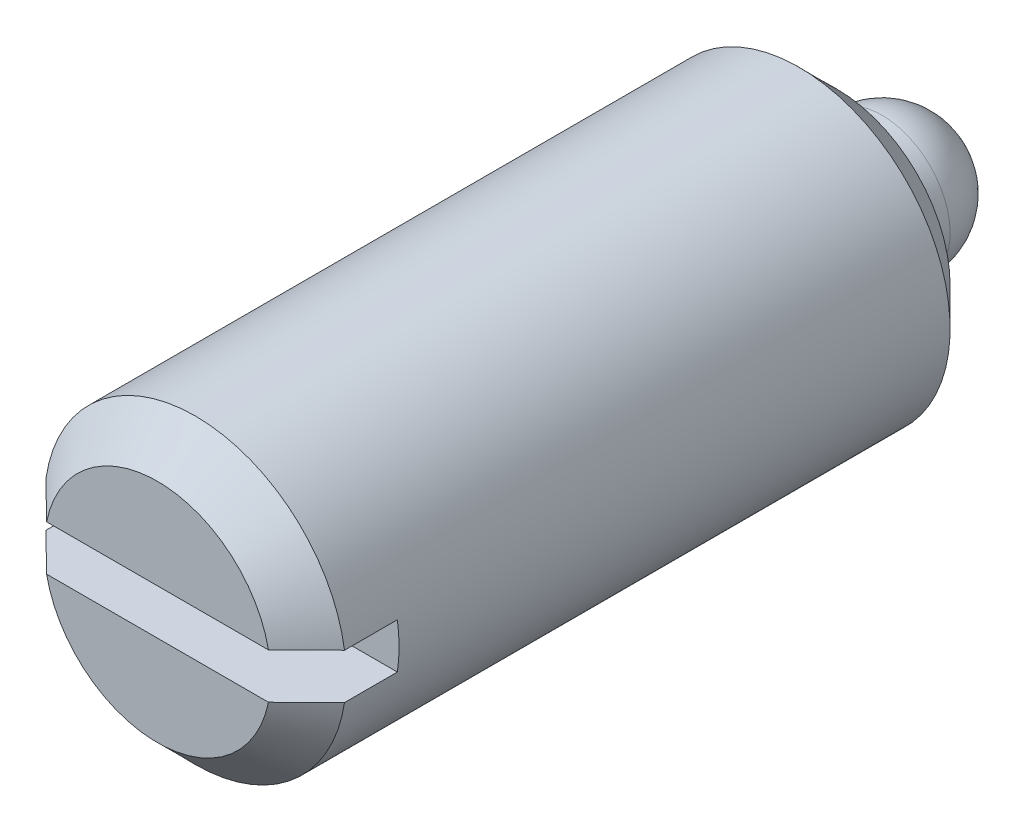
ISO-10303-21;
HEADER;
FILE_DESCRIPTION(('STEP AP214'),'2;1');
FILE_NAME('part.step','',(''),(''),'','','');
FILE_SCHEMA(('AUTOMOTIVE_DESIGN { 1 0 10303 214 1 1 1 1 }'));
ENDSEC;
DATA;
#1=APPLICATION_CONTEXT('core data for automotive mechanical design processes');
#2=APPLICATION_PROTOCOL_DEFINITION('international standard','automotive_design',2000,#1);
#3=PRODUCT_CONTEXT('',#1,'mechanical');
#4=PRODUCT('Part','Part','',(#3));
#5=PRODUCT_RELATED_PRODUCT_CATEGORY('part','',(#4));
#6=PRODUCT_DEFINITION_FORMATION('','',#4);
#7=PRODUCT_DEFINITION_CONTEXT('part definition',#1,'design');
#8=PRODUCT_DEFINITION('design','',#6,#7);
#9=PRODUCT_DEFINITION_SHAPE('','',#8);
#10=(LENGTH_UNIT() NAMED_UNIT(*) SI_UNIT(.MILLI.,.METRE.));
#11=(NAMED_UNIT(*) PLANE_ANGLE_UNIT() SI_UNIT($,.RADIAN.));
#12=(NAMED_UNIT(*) SI_UNIT($,.STERADIAN.) SOLID_ANGLE_UNIT());
#13=UNCERTAINTY_MEASURE_WITH_UNIT(LENGTH_MEASURE(1.E-05),#10,'distance_accuracy_value','');
#14=(GEOMETRIC_REPRESENTATION_CONTEXT(3) GLOBAL_UNCERTAINTY_ASSIGNED_CONTEXT((#13)) GLOBAL_UNIT_ASSIGNED_CONTEXT((#10,
#11,#12)) REPRESENTATION_CONTEXT('',''));
#15=CARTESIAN_POINT('',(0.,0.,0.));
#16=DIRECTION('',(0.,0.,1.));
#17=DIRECTION('',(1.,0.,0.));
#18=AXIS2_PLACEMENT_3D('',#15,#16,#17);
#19=CARTESIAN_POINT('',(-5.98901694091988E-11,-9.E-09,0.9));
#20=DIRECTION('',(-6.65446347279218E-11,0.,1.));
#21=DIRECTION('',(0.,-1.,0.));
#22=AXIS2_PLACEMENT_3D('',#19,#20,#21);
#23=SPHERICAL_SURFACE('',#22,0.9);
#24=CARTESIAN_POINT('',(0.,0.,0.));
#25=VERTEX_POINT('',#24);
#26=VERTEX_LOOP('',#25);
#27=FACE_BOUND('',#26,.T.);
#28=CARTESIAN_POINT('',(-5.98901694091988E-11,-9.E-09,0.9));
#29=DIRECTION('',(-6.65446347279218E-11,0.,1.));
#30=DIRECTION('',(-1.,0.,-6.65446347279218E-11));
#31=AXIS2_PLACEMENT_3D('',#28,#29,#30);
#32=CIRCLE('',#31,0.9);
#33=CARTESIAN_POINT('',(-0.90000000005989,-9.E-09,0.89999999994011));
#34=VERTEX_POINT('',#33);
#35=EDGE_CURVE('E78',#34,#34,#32,.T.);
#36=ORIENTED_EDGE('',*,*,#35,.F.);
#37=EDGE_LOOP('',(#36));
#38=FACE_BOUND('',#37,.T.);
#39=ADVANCED_FACE('F15',(#27,#38),#23,.T.);
#40=CARTESIAN_POINT('',(-5.98901694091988E-11,-9.E-09,0.9));
#41=DIRECTION('',(-6.65446347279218E-11,0.,1.));
#42=DIRECTION('',(-1.,0.,-6.65446347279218E-11));
#43=AXIS2_PLACEMENT_3D('',#40,#41,#42);
#44=CYLINDRICAL_SURFACE('',#43,0.9);
#45=CARTESIAN_POINT('',(-9.98169502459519E-11,-9.E-09,1.5));
#46=DIRECTION('',(-6.65446347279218E-11,0.,1.));
#47=DIRECTION('',(-1.,0.,-6.65446347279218E-11));
#48=AXIS2_PLACEMENT_3D('',#45,#46,#47);
#49=CIRCLE('',#48,0.9);
#50=CARTESIAN_POINT('',(-0.900000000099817,-9.E-09,1.49999999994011));
#51=VERTEX_POINT('',#50);
#52=EDGE_CURVE('E19',#51,#51,#49,.F.);
#53=ORIENTED_EDGE('',*,*,#52,.T.);
#54=EDGE_LOOP('',(#53));
#55=FACE_BOUND('',#54,.T.);
#56=ORIENTED_EDGE('',*,*,#35,.T.);
#57=EDGE_LOOP('',(#56));
#58=FACE_BOUND('',#57,.T.);
#59=ADVANCED_FACE('F74',(#55,#58),#44,.T.);
#60=CARTESIAN_POINT('',(-1.48733017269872,1.519292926,10.499999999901));
#61=DIRECTION('',(6.65446347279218E-11,0.,-1.));
#62=DIRECTION('',(1.,0.,6.65446347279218E-11));
#63=AXIS2_PLACEMENT_3D('',#60,#61,#62);
#64=PLANE('',#63);
#65=DIRECTION('',(1.,0.,6.65446347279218E-11));
#66=VECTOR('',#65,1.);
#67=CARTESIAN_POINT('',(-6.98718662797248E-10,0.299999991,10.5));
#68=LINE('',#67,#66);
#69=CARTESIAN_POINT('',(-1.46969384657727,0.299999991,10.4999999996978));
#70=VERTEX_POINT('',#69);
#71=CARTESIAN_POINT('',(1.46969384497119,0.299999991,10.5000000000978));
#72=VERTEX_POINT('',#71);
#73=EDGE_CURVE('E145',#70,#72,#68,.T.);
#74=ORIENTED_EDGE('',*,*,#73,.T.);
#75=CARTESIAN_POINT('',(-6.98718662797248E-10,-9.E-09,10.5));
#76=DIRECTION('',(6.65446347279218E-11,0.,-1.));
#77=DIRECTION('',(1.,0.,6.65446347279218E-11));
#78=AXIS2_PLACEMENT_3D('',#75,#76,#77);
#79=CIRCLE('',#78,1.5);
#80=EDGE_CURVE('E68',#70,#72,#79,.T.);
#81=ORIENTED_EDGE('',*,*,#80,.F.);
#82=EDGE_LOOP('',(#74,#81));
#83=FACE_BOUND('',#82,.T.);
#84=ADVANCED_FACE('F172',(#83),#64,.F.);
#85=CARTESIAN_POINT('',(1.51799999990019,1.523223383,1.50000000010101));
#86=DIRECTION('',(-6.65446347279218E-11,0.,1.));
#87=DIRECTION('',(-1.,0.,-6.65446347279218E-11));
#88=AXIS2_PLACEMENT_3D('',#85,#86,#87);
#89=PLANE('',#88);
#90=ORIENTED_EDGE('',*,*,#52,.F.);
#91=EDGE_LOOP('',(#90));
#92=FACE_BOUND('',#91,.T.);
#93=CARTESIAN_POINT('',(-9.98169502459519E-11,-9.E-09,1.5));
#94=DIRECTION('',(-6.65446347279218E-11,0.,1.));
#95=DIRECTION('',(-1.,0.,-6.65446347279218E-11));
#96=AXIS2_PLACEMENT_3D('',#93,#94,#95);
#97=CIRCLE('',#96,1.5);
#98=CARTESIAN_POINT('',(-1.50000000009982,-9.E-09,1.49999999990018));
#99=VERTEX_POINT('',#98);
#100=EDGE_CURVE('E186',#99,#99,#97,.T.);
#101=ORIENTED_EDGE('',*,*,#100,.F.);
#102=EDGE_LOOP('',(#101));
#103=FACE_BOUND('',#102,.T.);
#104=ADVANCED_FACE('F174',(#92,#103),#89,.F.);
#105=CARTESIAN_POINT('',(-1.48733017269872,-0.300000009,10.499999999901));
#106=DIRECTION('',(6.65446347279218E-11,0.,-1.));
#107=DIRECTION('',(1.,0.,6.65446347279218E-11));
#108=AXIS2_PLACEMENT_3D('',#105,#106,#107);
#109=PLANE('',#108);
#110=DIRECTION('',(-1.,0.,-6.65446347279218E-11));
#111=VECTOR('',#110,1.);
#112=CARTESIAN_POINT('',(-6.98718662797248E-10,-0.300000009,10.5));
#113=LINE('',#112,#111);
#114=CARTESIAN_POINT('',(1.46969384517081,-0.300000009,10.4999999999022));
#115=VERTEX_POINT('',#114);
#116=CARTESIAN_POINT('',(-1.46969384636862,-0.300000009,10.4999999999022));
#117=VERTEX_POINT('',#116);
#118=EDGE_CURVE('E104',#115,#117,#113,.T.);
#119=ORIENTED_EDGE('',*,*,#118,.T.);
#120=CARTESIAN_POINT('',(-6.98718662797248E-10,-9.E-09,10.5));
#121=DIRECTION('',(6.65446347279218E-11,0.,-1.));
#122=DIRECTION('',(1.,0.,6.65446347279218E-11));
#123=AXIS2_PLACEMENT_3D('',#120,#121,#122);
#124=CIRCLE('',#123,1.5);
#125=EDGE_CURVE('E188',#115,#117,#124,.T.);
#126=ORIENTED_EDGE('',*,*,#125,.F.);
#127=EDGE_LOOP('',(#119,#126));
#128=FACE_BOUND('',#127,.T.);
#129=ADVANCED_FACE('F127',(#128),#109,.F.);
#130=CARTESIAN_POINT('',(-6.98718662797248E-10,-9.E-09,10.5));
#131=DIRECTION('',(6.65446347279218E-11,0.,-1.));
#132=DIRECTION('',(1.,0.,6.65446347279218E-11));
#133=AXIS2_PLACEMENT_3D('',#130,#131,#132);
#134=CONICAL_SURFACE('',#133,1.5,0.785398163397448);
#135=ORIENTED_EDGE('',*,*,#80,.T.);
#136=CARTESIAN_POINT('',(1.46969384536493,0.299999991,10.499999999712));
#137=CARTESIAN_POINT('',(1.51210680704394,0.299999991,10.4584415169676));
#138=CARTESIAN_POINT('',(1.55448600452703,0.299999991,10.4168486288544));
#139=CARTESIAN_POINT('',(1.63918756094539,0.299999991,10.3336051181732));
#140=CARTESIAN_POINT('',(1.6815099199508,0.299999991,10.2919544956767));
#141=CARTESIAN_POINT('',(1.80840793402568,0.299999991,10.1669324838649));
#142=CARTESIAN_POINT('',(1.89291452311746,0.299999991,10.0834909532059));
#143=CARTESIAN_POINT('',(1.9773719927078,0.299999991,10.0000000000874));
#144=B_SPLINE_CURVE_WITH_KNOTS('',3,(#136,#137,#138,#139,#140,#141,#142,#143),.UNSPECIFIED.,.F.,
.F.,(4,2,2,4),(0.,0.178139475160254,0.356278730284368,0.712557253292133),.UNSPECIFIED.);
#145=CARTESIAN_POINT('',(1.97737199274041,0.299999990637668,10.0000000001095));
#146=VERTEX_POINT('',#145);
#147=EDGE_CURVE('E131',#72,#146,#144,.T.);
#148=ORIENTED_EDGE('',*,*,#147,.T.);
#149=CARTESIAN_POINT('',(-6.65446345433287E-10,-9.E-09,10.));
#150=DIRECTION('',(-6.65446347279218E-11,0.,1.));
#151=DIRECTION('',(-1.,0.,-6.65446347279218E-11));
#152=AXIS2_PLACEMENT_3D('',#149,#150,#151);
#153=CIRCLE('',#152,2.);
#154=CARTESIAN_POINT('',(-1.97737199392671,0.299999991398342,9.99999999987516));
#155=VERTEX_POINT('',#154);
#156=EDGE_CURVE('E223',#155,#146,#153,.F.);
#157=ORIENTED_EDGE('',*,*,#156,.F.);
#158=CARTESIAN_POINT('',(-1.97737199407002,0.299999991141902,9.99999999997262));
#159=CARTESIAN_POINT('',(-1.89291452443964,0.299999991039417,10.0834909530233));
#160=CARTESIAN_POINT('',(-1.80840793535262,0.299999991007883,10.16693248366));
#161=CARTESIAN_POINT('',(-1.68150992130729,0.299999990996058,10.291954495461));
#162=CARTESIAN_POINT('',(-1.63918756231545,0.299999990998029,10.3336051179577));
#163=CARTESIAN_POINT('',(-1.55448600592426,0.299999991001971,10.4168486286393));
#164=CARTESIAN_POINT('',(-1.51210680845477,0.299999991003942,10.4584415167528));
#165=CARTESIAN_POINT('',(-1.46969384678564,0.299999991,10.4999999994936));
#166=B_SPLINE_CURVE_WITH_KNOTS('',3,(#158,#159,#160,#161,#162,#163,#164,#165),.UNSPECIFIED.,.F.,
.F.,(4,2,2,4),(0.,0.356278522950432,0.534417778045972,0.712557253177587),.UNSPECIFIED.);
#167=EDGE_CURVE('E139',#155,#70,#166,.T.);
#168=ORIENTED_EDGE('',*,*,#167,.T.);
#169=EDGE_LOOP('',(#135,#148,#157,#168));
#170=FACE_BOUND('',#169,.T.);
#171=ADVANCED_FACE('F125',(#170),#134,.T.);
#172=CARTESIAN_POINT('',(-1.97737199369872,0.299999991,10.4999999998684));
#173=DIRECTION('',(0.,1.,0.));
#174=DIRECTION('',(1.,0.,6.65446347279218E-11));
#175=AXIS2_PLACEMENT_3D('',#172,#173,#174);
#176=PLANE('',#175);
#177=DIRECTION('',(6.65446347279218E-11,0.,-1.));
#178=VECTOR('',#177,1.);
#179=CARTESIAN_POINT('',(1.9773719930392,0.299999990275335,6.00000000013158));
#180=LINE('',#179,#178);
#181=CARTESIAN_POINT('',(1.97737199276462,0.299999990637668,9.30000000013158));
#182=VERTEX_POINT('',#181);
#183=EDGE_CURVE('E221',#146,#182,#180,.T.);
#184=ORIENTED_EDGE('',*,*,#183,.F.);
#185=ORIENTED_EDGE('',*,*,#147,.F.);
#186=ORIENTED_EDGE('',*,*,#73,.F.);
#187=ORIENTED_EDGE('',*,*,#167,.F.);
#188=DIRECTION('',(-6.65446347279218E-11,0.,1.));
#189=VECTOR('',#188,1.);
#190=CARTESIAN_POINT('',(-1.97737199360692,0.299999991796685,5.99999999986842));
#191=LINE('',#190,#189);
#192=CARTESIAN_POINT('',(-1.97737199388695,0.299999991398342,9.29999999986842));
#193=VERTEX_POINT('',#192);
#194=EDGE_CURVE('E86',#193,#155,#191,.T.);
#195=ORIENTED_EDGE('',*,*,#194,.F.);
#196=DIRECTION('',(1.,0.,6.65446347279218E-11));
#197=VECTOR('',#196,1.);
#198=CARTESIAN_POINT('',(-6.18865101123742E-10,0.299999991,9.3));
#199=LINE('',#198,#197);
#200=EDGE_CURVE('E103',#193,#182,#199,.T.);
#201=ORIENTED_EDGE('',*,*,#200,.T.);
#202=EDGE_LOOP('',(#184,#185,#186,#187,#195,#201));
#203=FACE_BOUND('',#202,.T.);
#204=ADVANCED_FACE('F119',(#203),#176,.F.);
#205=CARTESIAN_POINT('',(-9.98169502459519E-11,-9.E-09,1.5));
#206=DIRECTION('',(-6.65446347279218E-11,0.,1.));
#207=DIRECTION('',(-1.,0.,-6.65446347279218E-11));
#208=AXIS2_PLACEMENT_3D('',#205,#206,#207);
#209=CONICAL_SURFACE('',#208,1.5,0.785398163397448);
#210=CARTESIAN_POINT('',(-1.33089267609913E-10,-9.E-09,2.));
#211=DIRECTION('',(-6.65446347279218E-11,0.,1.));
#212=DIRECTION('',(-1.,0.,-6.65446347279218E-11));
#213=AXIS2_PLACEMENT_3D('',#210,#211,#212);
#214=CIRCLE('',#213,2.);
#215=CARTESIAN_POINT('',(-2.00000000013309,-9.E-09,1.99999999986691));
#216=VERTEX_POINT('',#215);
#217=EDGE_CURVE('E94',#216,#216,#214,.T.);
#218=ORIENTED_EDGE('',*,*,#217,.F.);
#219=EDGE_LOOP('',(#218));
#220=FACE_BOUND('',#219,.T.);
#221=ORIENTED_EDGE('',*,*,#100,.T.);
#222=EDGE_LOOP('',(#221));
#223=FACE_BOUND('',#222,.T.);
#224=ADVANCED_FACE('F124',(#220,#223),#209,.T.);
#225=CARTESIAN_POINT('',(-6.98718662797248E-10,-9.E-09,10.5));
#226=DIRECTION('',(6.65446347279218E-11,0.,-1.));
#227=DIRECTION('',(1.,0.,6.65446347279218E-11));
#228=AXIS2_PLACEMENT_3D('',#225,#226,#227);
#229=CONICAL_SURFACE('',#228,1.5,0.785398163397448);
#230=CARTESIAN_POINT('',(-6.65446345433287E-10,-9.E-09,10.));
#231=DIRECTION('',(-6.65446347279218E-11,0.,1.));
#232=DIRECTION('',(-1.,0.,-6.65446347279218E-11));
#233=AXIS2_PLACEMENT_3D('',#230,#231,#232);
#234=CIRCLE('',#233,2.);
#235=CARTESIAN_POINT('',(1.97737199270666,-0.300000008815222,10.0000000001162));
#236=VERTEX_POINT('',#235);
#237=CARTESIAN_POINT('',(-1.97737199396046,-0.300000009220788,9.99999999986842));
#238=VERTEX_POINT('',#237);
#239=EDGE_CURVE('E211',#236,#238,#234,.F.);
#240=ORIENTED_EDGE('',*,*,#239,.F.);
#241=CARTESIAN_POINT('',(1.97737199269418,-0.300000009,10.0000000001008));
#242=CARTESIAN_POINT('',(1.89291452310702,-0.300000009,10.0834909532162));
#243=CARTESIAN_POINT('',(1.80840793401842,-0.300000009,10.1669324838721));
#244=CARTESIAN_POINT('',(1.68150991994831,-0.300000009,10.2919544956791));
#245=CARTESIAN_POINT('',(1.63918756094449,-0.300000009,10.3336051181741));
#246=CARTESIAN_POINT('',(1.55448600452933,-0.300000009,10.4168486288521));
#247=CARTESIAN_POINT('',(1.51210680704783,-0.300000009,10.4584415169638));
#248=CARTESIAN_POINT('',(1.46969384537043,-0.300000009,10.4999999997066));
#249=B_SPLINE_CURVE_WITH_KNOTS('',3,(#241,#242,#243,#244,#245,#246,#247,#248),.UNSPECIFIED.,.F.,
.F.,(4,2,2,4),(0.,0.356278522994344,0.534417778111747,0.712557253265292),.UNSPECIFIED.);
#250=EDGE_CURVE('E105',#236,#115,#249,.T.);
#251=ORIENTED_EDGE('',*,*,#250,.T.);
#252=ORIENTED_EDGE('',*,*,#125,.T.);
#253=CARTESIAN_POINT('',(-1.46969384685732,-0.300000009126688,10.4999999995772));
#254=CARTESIAN_POINT('',(-1.51210680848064,-0.300000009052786,10.4584415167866));
#255=CARTESIAN_POINT('',(-1.55448600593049,-0.300000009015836,10.41684862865));
#256=CARTESIAN_POINT('',(-1.63918756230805,-0.300000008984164,10.3336051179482));
#257=CARTESIAN_POINT('',(-1.68150992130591,-0.300000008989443,10.2919544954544));
#258=CARTESIAN_POINT('',(-1.80840793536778,-0.300000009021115,10.1669324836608));
#259=CARTESIAN_POINT('',(-1.89291452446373,-0.300000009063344,10.0834909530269));
#260=CARTESIAN_POINT('',(-1.9773719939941,-0.300000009,9.99999999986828));
#261=B_SPLINE_CURVE_WITH_KNOTS('',3,(#253,#254,#255,#256,#257,#258,#259,#260),.UNSPECIFIED.,.F.,
.F.,(4,2,2,4),(0.,0.178139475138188,0.356278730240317,0.712557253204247),.UNSPECIFIED.);
#262=EDGE_CURVE('E95',#117,#238,#261,.T.);
#263=ORIENTED_EDGE('',*,*,#262,.T.);
#264=EDGE_LOOP('',(#240,#251,#252,#263));
#265=FACE_BOUND('',#264,.T.);
#266=ADVANCED_FACE('F111',(#265),#229,.T.);
#267=CARTESIAN_POINT('',(1.97737199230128,-0.300000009,10.5000000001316));
#268=DIRECTION('',(0.,-1.,0.));
#269=DIRECTION('',(-1.,0.,-6.65446347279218E-11));
#270=AXIS2_PLACEMENT_3D('',#267,#268,#269);
#271=PLANE('',#270);
#272=ORIENTED_EDGE('',*,*,#118,.F.);
#273=ORIENTED_EDGE('',*,*,#250,.F.);
#274=DIRECTION('',(-6.65446347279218E-11,0.,1.));
#275=VECTOR('',#274,1.);
#276=CARTESIAN_POINT('',(1.97737199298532,-0.300000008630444,6.00000000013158));
#277=LINE('',#276,#275);
#278=CARTESIAN_POINT('',(1.97737199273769,-0.300000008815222,9.30000000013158));
#279=VERTEX_POINT('',#278);
#280=EDGE_CURVE('E93',#279,#236,#277,.T.);
#281=ORIENTED_EDGE('',*,*,#280,.F.);
#282=DIRECTION('',(-1.,0.,-6.65446347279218E-11));
#283=VECTOR('',#282,1.);
#284=CARTESIAN_POINT('',(-6.18865101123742E-10,-0.300000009,9.3));
#285=LINE('',#284,#283);
#286=CARTESIAN_POINT('',(-1.97737199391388,-0.300000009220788,9.29999999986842));
#287=VERTEX_POINT('',#286);
#288=EDGE_CURVE('E35',#279,#287,#285,.T.);
#289=ORIENTED_EDGE('',*,*,#288,.T.);
#290=DIRECTION('',(6.65446347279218E-11,0.,-1.));
#291=VECTOR('',#290,1.);
#292=CARTESIAN_POINT('',(-1.97737199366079,-0.300000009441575,5.99999999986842));
#293=LINE('',#292,#291);
#294=EDGE_CURVE('E26',#238,#287,#293,.T.);
#295=ORIENTED_EDGE('',*,*,#294,.F.);
#296=ORIENTED_EDGE('',*,*,#262,.F.);
#297=EDGE_LOOP('',(#272,#273,#281,#289,#295,#296));
#298=FACE_BOUND('',#297,.T.);
#299=ADVANCED_FACE('F115',(#298),#271,.F.);
#300=CARTESIAN_POINT('',(-2.02400000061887,0.299999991,9.29999999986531));
#301=DIRECTION('',(6.65446347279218E-11,0.,-1.));
#302=DIRECTION('',(1.,0.,6.65446347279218E-11));
#303=AXIS2_PLACEMENT_3D('',#300,#301,#302);
#304=PLANE('',#303);
#305=CARTESIAN_POINT('',(-6.18865101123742E-10,-9.E-09,9.3));
#306=DIRECTION('',(-6.65446347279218E-11,0.,1.));
#307=DIRECTION('',(-1.,0.,-6.65446347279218E-11));
#308=AXIS2_PLACEMENT_3D('',#305,#306,#307);
#309=CIRCLE('',#308,2.);
#310=EDGE_CURVE('E89',#182,#279,#309,.F.);
#311=ORIENTED_EDGE('',*,*,#310,.F.);
#312=ORIENTED_EDGE('',*,*,#200,.F.);
#313=CARTESIAN_POINT('',(-6.18865101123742E-10,-9.E-09,9.3));
#314=DIRECTION('',(-6.65446347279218E-11,0.,1.));
#315=DIRECTION('',(-1.,0.,-6.65446347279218E-11));
#316=AXIS2_PLACEMENT_3D('',#313,#314,#315);
#317=CIRCLE('',#316,2.);
#318=EDGE_CURVE('E9',#287,#193,#317,.F.);
#319=ORIENTED_EDGE('',*,*,#318,.F.);
#320=ORIENTED_EDGE('',*,*,#288,.F.);
#321=EDGE_LOOP('',(#311,#312,#319,#320));
#322=FACE_BOUND('',#321,.T.);
#323=ADVANCED_FACE('F17',(#322),#304,.F.);
#324=CARTESIAN_POINT('',(-1.33089267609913E-10,-9.E-09,2.));
#325=DIRECTION('',(-6.65446347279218E-11,0.,1.));
#326=DIRECTION('',(-1.,0.,-6.65446347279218E-11));
#327=AXIS2_PLACEMENT_3D('',#324,#325,#326);
#328=CYLINDRICAL_SURFACE('',#327,2.);
#329=ORIENTED_EDGE('',*,*,#183,.T.);
#330=ORIENTED_EDGE('',*,*,#310,.T.);
#331=ORIENTED_EDGE('',*,*,#280,.T.);
#332=ORIENTED_EDGE('',*,*,#239,.T.);
#333=ORIENTED_EDGE('',*,*,#294,.T.);
#334=ORIENTED_EDGE('',*,*,#318,.T.);
#335=ORIENTED_EDGE('',*,*,#194,.T.);
#336=ORIENTED_EDGE('',*,*,#156,.T.);
#337=EDGE_LOOP('',(#329,#330,#331,#332,#333,#334,#335,#336));
#338=FACE_BOUND('',#337,.T.);
#339=ORIENTED_EDGE('',*,*,#217,.T.);
#340=EDGE_LOOP('',(#339));
#341=FACE_BOUND('',#340,.T.);
#342=ADVANCED_FACE('F161',(#338,#341),#328,.T.);
#343=CLOSED_SHELL('',(#39,#59,#84,#104,#129,#171,#204,#224,#266,#299,#323,#342));
#344=MANIFOLD_SOLID_BREP('B1',#343);
#345=ADVANCED_BREP_SHAPE_REPRESENTATION('',(#18,#344),#14);
#346=SHAPE_DEFINITION_REPRESENTATION(#9,#345);
ENDSEC;
END-ISO-10303-21;
